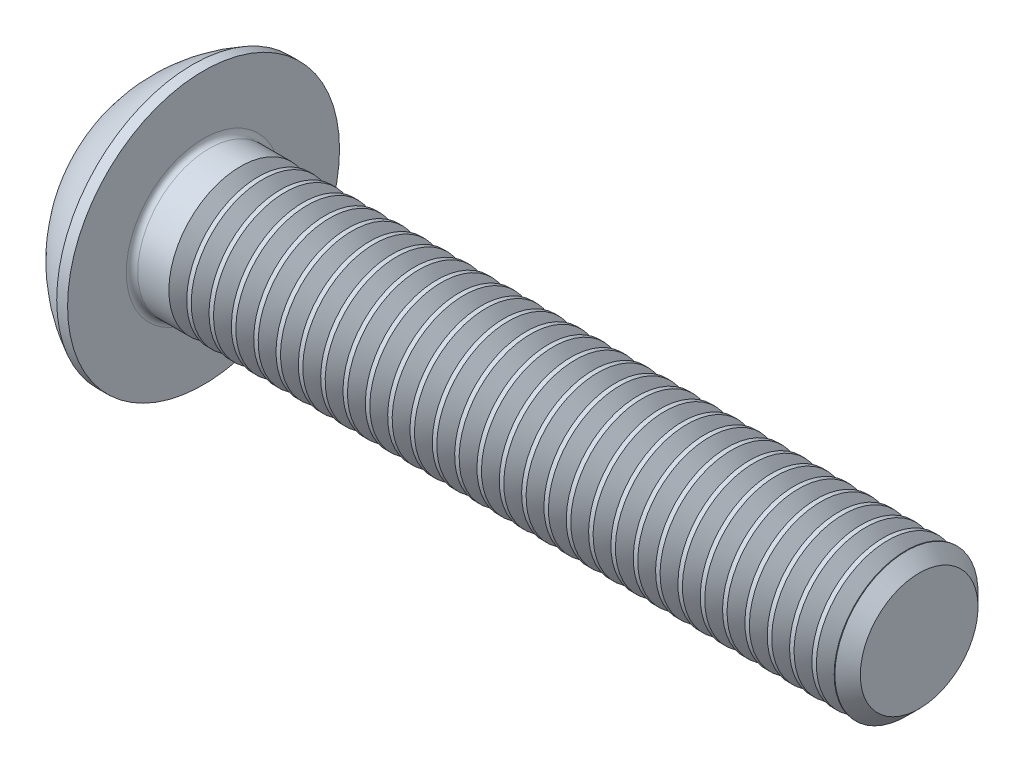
from build123d import *

# Parameters (mm, degrees)
FILLET1_R       = 0.2
HEX_2_DEPTH     = 1.56
THDSCHPAT_COUNT = 30
THDSCHPAT_PITCH = 0.78


with BuildPart() as part:
    # BodySke → BaseBody (revolve)
    with BuildSketch(Plane.XY, mode=Mode.PRIVATE) as basebody_sk:
        with BuildLine():
            Line((27.75, 0), (27.75, 2.055))
            Line((27.75, 2.055), (27.305, 2.5))
            Line((27.305, 2.5), (2.75, 2.5))
            Line((2.75, 2.5), (2.75, 4.75))
            Line((2.75, 4.75), (2.37, 4.75))
            ThreePointArc((2.37, 4.75), (0.992680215, 3.754414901), (0, 2.375))
            Line((0, 2.375), (0, 0))
            Line((0, 0), (27.75, 0))
        make_face()
    revolve(basebody_sk.sketch.rotate(Axis((0, 0, 0), (1, 0, 0)), 90), axis=Axis((0, 0, 0), (1, 0, 0)))

    # Fillet1
    fillet1_edges = [part.edges().sort_by_distance(p)[0] for p in [
        (2.75, 0, -2.5),
    ]]
    fillet(fillet1_edges, radius=FILLET1_R)

    # Sketch2 → PreBroach (revolve, cut)
    with BuildSketch(Plane.XY, mode=Mode.PRIVATE) as prebroach_sk:
        Polygon((0, 1.5), (1.56, 1.5), (2.426025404, 0), (0, 0), align=None)
    revolve(prebroach_sk.sketch.rotate(Axis((0, 0, 0), (1, 0, 0)), 90), axis=Axis((0, 0, 0), (1, 0, 0)), mode=Mode.SUBTRACT)

    # Sketch3 → Hex 2 (cut)
    with BuildSketch(Plane(origin=(0, 0, 0), x_dir=(0, 0, -1), z_dir=(1, 0, 0))):
        Polygon((-1.5, -0.866025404), (-1.5, 0.866025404), (0, 1.732050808), (1.5, 0.866025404), (1.5, -0.866025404), (0, -1.732050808), align=None)
    extrude(amount=HEX_2_DEPTH, mode=Mode.SUBTRACT)

    # ThdSchSke → ThreadSchematic (revolve, cut)
    with BuildSketch(Plane.XY, mode=Mode.PRIVATE) as threadschematic_sk:
        Polygon((4.35, -2.055), (4.038407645, -2.5), (4.038407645, -3.125), (4.661592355, -3.125), (4.661592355, -2.5), align=None)
    threadschematic = revolve(threadschematic_sk.sketch.rotate(Axis((-3.175, 0, 0), (1, 0, 0)), 270), axis=Axis((-3.175, 0, 0), (1, 0, 0)), mode=Mode.SUBTRACT)

    # ThdSchPat: ThreadSchematic ×30
    with Locations(*[(i * THDSCHPAT_PITCH, 0, 0) for i in range(1, THDSCHPAT_COUNT)]):
        add(threadschematic, mode=Mode.SUBTRACT)


solid = part.part
